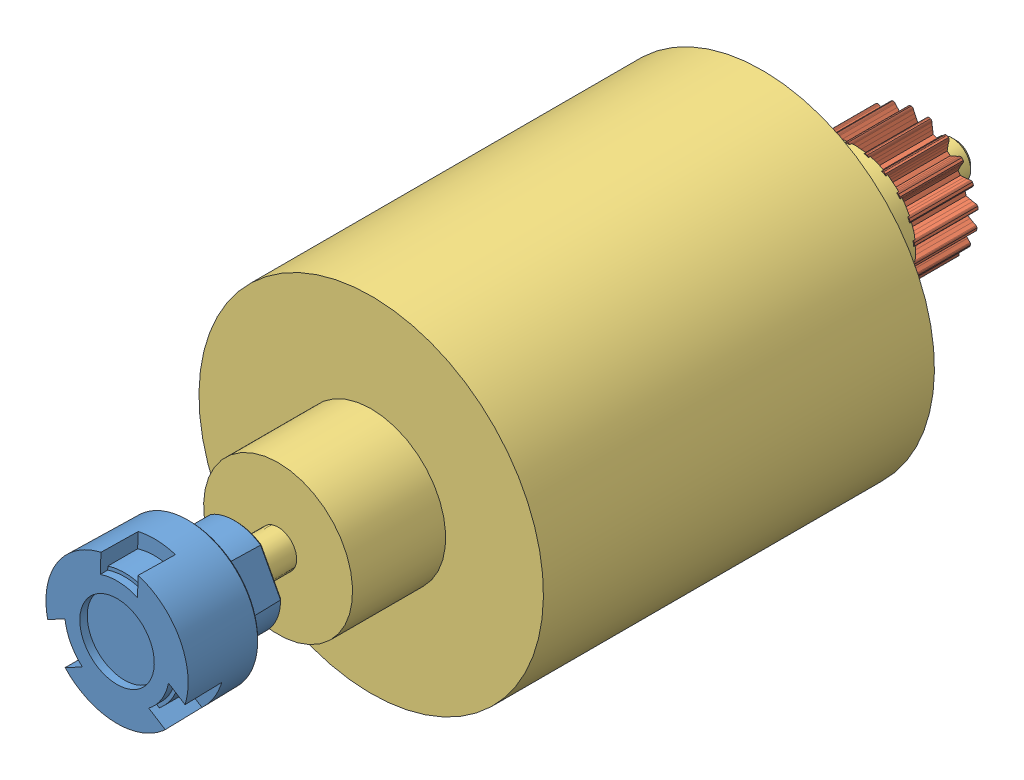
SolidWorks assembly Rotor_moteur_tangage.sldasm, configuration Défaut (file format 10000). Lengths in mm.
Overall size (20.2 20.2 45.05).
3 component instances, 3 part files, 0 mates.
Components (placement in the parent):
- ALD_M010053__P_support_aimant-1: ALD_M010053__P_support_aimant.sldprt [Default] at (12.0374 -33.4777 20.4853) x (0.99932 -0.036877 0) z (-0.036877 -0.99932 0) size (7.64 6.4 7.6)
- ALD6667-1: ALD6667.SLDPRT [Default] at (12.0374 -33.4777 -12.6647) x (-0.191867 -0.981421 0) z (0.981421 -0.191867 0) size (6.6 3.4 6.59)
- ALD_M840031__P_Portescap_22NT_82_213P_Z20_Rotor-1: ALD_M840031__P_Portescap_22NT_82_213P_Z20_Rotor.sldprt [Default] at (12.0374 -33.4777 17.2347) x (0.995346 0.096369 0) z (-0.096369 0.995346 0) size (18.5 41.3 18.5)
